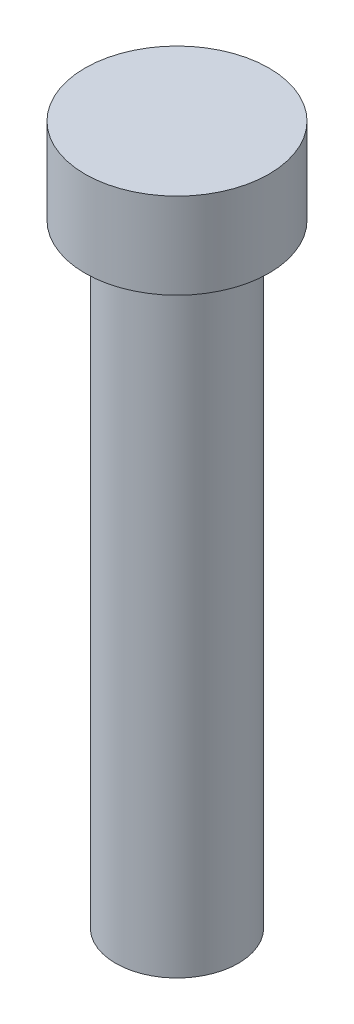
ISO-10303-21;
HEADER;
FILE_DESCRIPTION(('STEP AP214'),'2;1');
FILE_NAME('part.step','',(''),(''),'','','');
FILE_SCHEMA(('AUTOMOTIVE_DESIGN { 1 0 10303 214 1 1 1 1 }'));
ENDSEC;
DATA;
#1=APPLICATION_CONTEXT('core data for automotive mechanical design processes');
#2=APPLICATION_PROTOCOL_DEFINITION('international standard','automotive_design',2000,#1);
#3=PRODUCT_CONTEXT('',#1,'mechanical');
#4=PRODUCT('Part','Part','',(#3));
#5=PRODUCT_RELATED_PRODUCT_CATEGORY('part','',(#4));
#6=PRODUCT_DEFINITION_FORMATION('','',#4);
#7=PRODUCT_DEFINITION_CONTEXT('part definition',#1,'design');
#8=PRODUCT_DEFINITION('design','',#6,#7);
#9=PRODUCT_DEFINITION_SHAPE('','',#8);
#10=(LENGTH_UNIT() NAMED_UNIT(*) SI_UNIT(.MILLI.,.METRE.));
#11=(NAMED_UNIT(*) PLANE_ANGLE_UNIT() SI_UNIT($,.RADIAN.));
#12=(NAMED_UNIT(*) SI_UNIT($,.STERADIAN.) SOLID_ANGLE_UNIT());
#13=UNCERTAINTY_MEASURE_WITH_UNIT(LENGTH_MEASURE(1.E-05),#10,'distance_accuracy_value','');
#14=(GEOMETRIC_REPRESENTATION_CONTEXT(3) GLOBAL_UNCERTAINTY_ASSIGNED_CONTEXT((#13)) GLOBAL_UNIT_ASSIGNED_CONTEXT((#10,
#11,#12)) REPRESENTATION_CONTEXT('',''));
#15=CARTESIAN_POINT('',(0.,0.,0.));
#16=DIRECTION('',(0.,0.,1.));
#17=DIRECTION('',(1.,0.,0.));
#18=AXIS2_PLACEMENT_3D('',#15,#16,#17);
#19=CARTESIAN_POINT('',(0.,50.,0.));
#20=DIRECTION('',(0.,-1.,0.));
#21=DIRECTION('',(0.,0.,-1.));
#22=AXIS2_PLACEMENT_3D('',#19,#20,#21);
#23=CYLINDRICAL_SURFACE('',#22,5.);
#24=CARTESIAN_POINT('',(0.,50.,0.));
#25=DIRECTION('',(0.,1.,0.));
#26=DIRECTION('',(0.,0.,1.));
#27=AXIS2_PLACEMENT_3D('',#24,#25,#26);
#28=CIRCLE('',#27,5.);
#29=CARTESIAN_POINT('',(0.,50.,5.));
#30=VERTEX_POINT('',#29);
#31=EDGE_CURVE('E10',#30,#30,#28,.T.);
#32=ORIENTED_EDGE('',*,*,#31,.F.);
#33=EDGE_LOOP('',(#32));
#34=FACE_BOUND('',#33,.T.);
#35=CARTESIAN_POINT('',(0.,0.,0.));
#36=DIRECTION('',(0.,1.,0.));
#37=DIRECTION('',(0.,0.,1.));
#38=AXIS2_PLACEMENT_3D('',#35,#36,#37);
#39=CIRCLE('',#38,5.);
#40=CARTESIAN_POINT('',(0.,0.,5.));
#41=VERTEX_POINT('',#40);
#42=EDGE_CURVE('E34',#41,#41,#39,.T.);
#43=ORIENTED_EDGE('',*,*,#42,.T.);
#44=EDGE_LOOP('',(#43));
#45=FACE_BOUND('',#44,.T.);
#46=ADVANCED_FACE('F31',(#34,#45),#23,.T.);
#47=CARTESIAN_POINT('',(0.,0.,0.));
#48=DIRECTION('',(0.,1.,0.));
#49=DIRECTION('',(0.,0.,1.));
#50=AXIS2_PLACEMENT_3D('',#47,#48,#49);
#51=PLANE('',#50);
#52=ORIENTED_EDGE('',*,*,#42,.F.);
#53=EDGE_LOOP('',(#52));
#54=FACE_BOUND('',#53,.T.);
#55=ADVANCED_FACE('F54',(#54),#51,.F.);
#56=CARTESIAN_POINT('',(0.,57.,0.));
#57=DIRECTION('',(0.,-1.,0.));
#58=DIRECTION('',(0.,0.,-1.));
#59=AXIS2_PLACEMENT_3D('',#56,#57,#58);
#60=CYLINDRICAL_SURFACE('',#59,7.5);
#61=CARTESIAN_POINT('',(0.,57.,0.));
#62=DIRECTION('',(0.,1.,0.));
#63=DIRECTION('',(0.,0.,1.));
#64=AXIS2_PLACEMENT_3D('',#61,#62,#63);
#65=CIRCLE('',#64,7.5);
#66=CARTESIAN_POINT('',(0.,57.,7.5));
#67=VERTEX_POINT('',#66);
#68=EDGE_CURVE('E41',#67,#67,#65,.T.);
#69=ORIENTED_EDGE('',*,*,#68,.F.);
#70=EDGE_LOOP('',(#69));
#71=FACE_BOUND('',#70,.T.);
#72=CARTESIAN_POINT('',(0.,50.,0.));
#73=DIRECTION('',(0.,1.,0.));
#74=DIRECTION('',(0.,0.,1.));
#75=AXIS2_PLACEMENT_3D('',#72,#73,#74);
#76=CIRCLE('',#75,7.5);
#77=CARTESIAN_POINT('',(0.,50.,7.5));
#78=VERTEX_POINT('',#77);
#79=EDGE_CURVE('E43',#78,#78,#76,.T.);
#80=ORIENTED_EDGE('',*,*,#79,.T.);
#81=EDGE_LOOP('',(#80));
#82=FACE_BOUND('',#81,.T.);
#83=ADVANCED_FACE('F51',(#71,#82),#60,.T.);
#84=CARTESIAN_POINT('',(0.,57.,0.));
#85=DIRECTION('',(0.,1.,0.));
#86=DIRECTION('',(0.,0.,1.));
#87=AXIS2_PLACEMENT_3D('',#84,#85,#86);
#88=PLANE('',#87);
#89=ORIENTED_EDGE('',*,*,#68,.T.);
#90=EDGE_LOOP('',(#89));
#91=FACE_BOUND('',#90,.T.);
#92=ADVANCED_FACE('F49',(#91),#88,.T.);
#93=CARTESIAN_POINT('',(0.,50.,0.));
#94=DIRECTION('',(0.,1.,0.));
#95=DIRECTION('',(0.,0.,1.));
#96=AXIS2_PLACEMENT_3D('',#93,#94,#95);
#97=PLANE('',#96);
#98=ORIENTED_EDGE('',*,*,#31,.T.);
#99=EDGE_LOOP('',(#98));
#100=FACE_BOUND('',#99,.T.);
#101=ORIENTED_EDGE('',*,*,#79,.F.);
#102=EDGE_LOOP('',(#101));
#103=FACE_BOUND('',#102,.T.);
#104=ADVANCED_FACE('F58',(#100,#103),#97,.F.);
#105=CLOSED_SHELL('',(#46,#55,#83,#92,#104));
#106=MANIFOLD_SOLID_BREP('B2',#105);
#107=ADVANCED_BREP_SHAPE_REPRESENTATION('',(#18,#106),#14);
#108=SHAPE_DEFINITION_REPRESENTATION(#9,#107);
ENDSEC;
END-ISO-10303-21;
